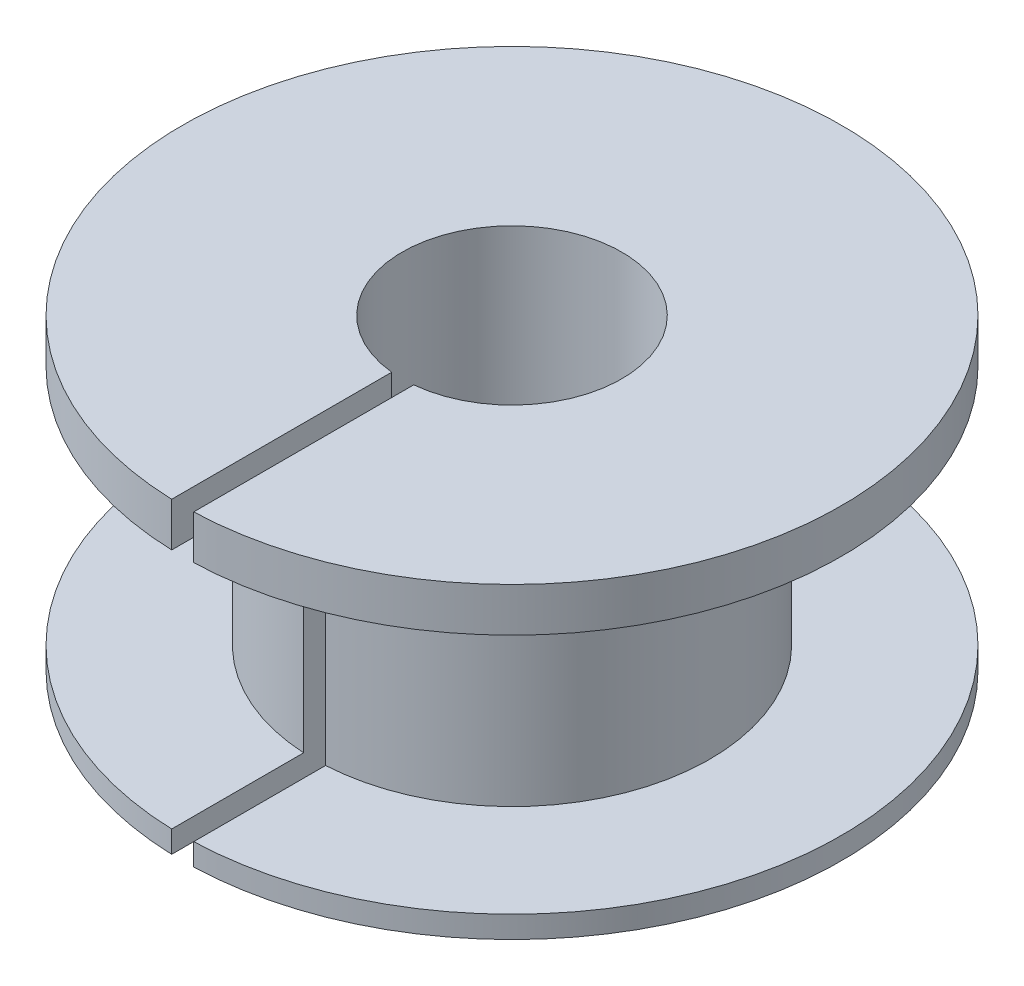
from build123d import *

# Parameters (mm, degrees)
ESQUISSE2_W             = 5
ESQUISSE2_H             = 80
ENL_V_MAT_EXTRU_2_DEPTH = 128.082650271


with BuildPart() as part:
    # Esquisse1 → R_volution1 (revolve)
    with BuildSketch(Plane.XY, mode=Mode.PRIVATE) as r_volution1_sk:
        Polygon((-75, 60), (-75, 70), (-25, 70), (-25, 0), (-75, 0), (-75, 5), (-45, 5), (-45, 60), align=None)
    revolve(r_volution1_sk.sketch.rotate(Axis((0, 0, 0), (0, 1, 0)), 270), axis=Axis((0, 0, 0), (0, 1, 0)))

    # Esquisse2 → Enl_v. mat.-Extru.2 (cut, through all)
    with BuildSketch(Plane(origin=(0, 0, 0), x_dir=(1, 0, 0), z_dir=(0, 1, 0))):
        with Locations((0, -51.784541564)):
            Rectangle(ESQUISSE2_W, ESQUISSE2_H)
    extrude(amount=ENL_V_MAT_EXTRU_2_DEPTH, mode=Mode.SUBTRACT)


solid = part.part
